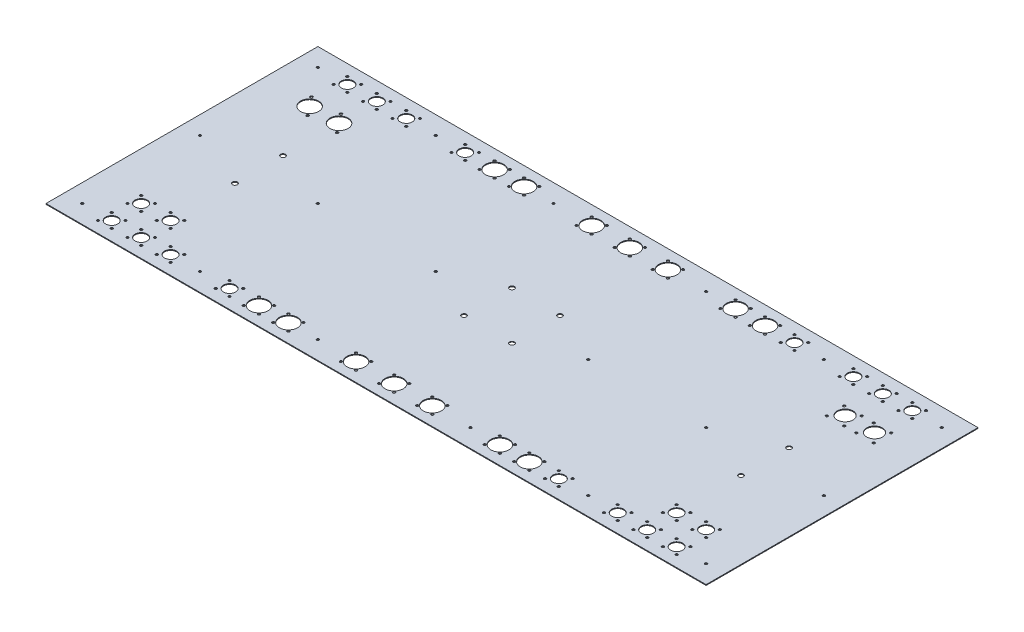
from build123d import *

# Parameters (mm, degrees)
MAIN_PLATE_W        = 874
MAIN_PLATE_H        = 360
BOSS_EXTRUDE1_DEPTH = 1.016
SKETCH2_R           = 1.6
SKETCH2_R_2         = 3.175
CUT_EXTRUDE1_DEPTH  = 473.620389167
FAN_R               = 1.6
FAN_R_2             = 12
CUT_EXTRUDE2_DEPTH  = 474.008271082
NTYPE_R             = 8
NTYPE_R_2           = 1.6
CUT_EXTRUDE3_DEPTH  = 473.620389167
ETHERNET_R          = 12
ETHERNET_R_2        = 1.755
CUT_EXTRUDE6_DEPTH  = 10
POWER_R             = 10.4521
POWER_R_2           = 1.5875
CUT_EXTRUDE7_DEPTH  = 10


with BuildPart() as part:
    # main_plate → Boss-Extrude1 (new body)
    with BuildSketch(Plane(origin=(0, 0, 0), x_dir=(1, 0, 0), z_dir=(0, 1, 0))):
        Rectangle(MAIN_PLATE_W, MAIN_PLATE_H)
    extrude(amount=BOSS_EXTRUDE1_DEPTH)

    # Sketch2 → Cut-Extrude1 (cut, through all)
    with BuildSketch(Plane(origin=(0, 1.016, 0), x_dir=(1, 0, 0), z_dir=(0, 1, 0))):
        with Locations(Location((-413, 156, 0), (0, 0, 270))):
            Circle(SKETCH2_R)
        with Locations(Location((-335, 31.805896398, 0), (0, 0, 270))):
            Circle(SKETCH2_R_2)
        with Locations(Location((-335, -31.805896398, 0), (0, 0, 90))):
            Circle(SKETCH2_R_2)
        with Locations(Location((-257, 156, 0), (0, 0, 270))):
            Circle(SKETCH2_R)
        with Locations(Location((-101, 156, 0), (0, 0, 270))):
            Circle(SKETCH2_R)
        with Locations(Location((-257, 0, 0), (0, 0, 270))):
            Circle(SKETCH2_R)
        with Locations(Location((-101, 0, 0), (0, 0, 270))):
            Circle(SKETCH2_R)
        with Locations(Location((-257, -156, 0), (0, 0, 270))):
            Circle(SKETCH2_R)
        with Locations(Location((-101, -156, 0), (0, 0, 270))):
            Circle(SKETCH2_R)
        with Locations(Location((-413, 0, 0), (0, 0, 270))):
            Circle(SKETCH2_R)
        with Locations(Location((-413, -156, 0), (0, 0, 270))):
            Circle(SKETCH2_R)
        with Locations(Location((-31.75, 31.75, 0), (0, 0, 270))):
            Circle(SKETCH2_R_2)
        with Locations(Location((-31.75, -31.75, 0), (0, 0, 90))):
            Circle(SKETCH2_R_2)
        with Locations(Location((31.75, -31.75, 0), (0, 0, 270))):
            Circle(SKETCH2_R_2)
        with Locations(Location((31.75, 31.75, 0), (0, 0, 90))):
            Circle(SKETCH2_R_2)
        with Locations(Location((413, -156, 0), (0, 0, 90))):
            Circle(SKETCH2_R)
        with Locations(Location((413, 0, 0), (0, 0, 90))):
            Circle(SKETCH2_R)
        with Locations(Location((101, -156, 0), (0, 0, 90))):
            Circle(SKETCH2_R)
        with Locations(Location((257, -156, 0), (0, 0, 90))):
            Circle(SKETCH2_R)
        with Locations(Location((101, 0, 0), (0, 0, 90))):
            Circle(SKETCH2_R)
        with Locations(Location((257, 0, 0), (0, 0, 90))):
            Circle(SKETCH2_R)
        with Locations(Location((101, 156, 0), (0, 0, 90))):
            Circle(SKETCH2_R)
        with Locations(Location((257, 156, 0), (0, 0, 90))):
            Circle(SKETCH2_R)
        with Locations(Location((335, -31.805896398, 0), (0, 0, 270))):
            Circle(SKETCH2_R_2)
        with Locations(Location((335, 31.805896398, 0), (0, 0, 90))):
            Circle(SKETCH2_R_2)
        with Locations(Location((413, 156, 0), (0, 0, 90))):
            Circle(SKETCH2_R)
    extrude(amount=-CUT_EXTRUDE1_DEPTH, mode=Mode.SUBTRACT)

    # fan → Cut-Extrude2 (cut, through all)
    with BuildSketch(Plane(origin=(0, 1.016, 1.016), x_dir=(1, 0, 0), z_dir=(0, 1, 0))):
        with Locations(Location((130, -144.984, 0), (0, 0, 270))):
            Circle(FAN_R)
        with Locations(Location((150, -144.984, 0), (0, 0, 270))):
            Circle(FAN_R)
        with Locations(Location((150, -164.984, 0), (0, 0, 270))):
            Circle(FAN_R)
        with Locations(Location((130, -164.984, 0), (0, 0, 270))):
            Circle(FAN_R)
        with Locations(Location((140, -154.984, 0), (0, 0, 270))):
            Circle(FAN_R_2)
        with Locations(Location((169, -144.984, 0), (0, 0, 270))):
            Circle(FAN_R)
        with Locations(Location((189, -144.984, 0), (0, 0, 270))):
            Circle(FAN_R)
        with Locations(Location((189, -164.984, 0), (0, 0, 270))):
            Circle(FAN_R)
        with Locations(Location((169, -164.984, 0), (0, 0, 270))):
            Circle(FAN_R)
        with Locations(Location((179, -154.984, 0), (0, 0, 270))):
            Circle(FAN_R_2)
        with Locations(Location((-10, -144.984, 0), (0, 0, 270))):
            Circle(FAN_R)
        with Locations(Location((10, -144.984, 0), (0, 0, 270))):
            Circle(FAN_R)
        with Locations(Location((10, -164.984, 0), (0, 0, 270))):
            Circle(FAN_R)
        with Locations(Location((-10, -164.984, 0), (0, 0, 270))):
            Circle(FAN_R)
        with Locations(Location((0, -154.984, 0), (0, 0, 270))):
            Circle(FAN_R_2)
        with Locations(Location((-60.5, -144.984, 0), (0, 0, 270))):
            Circle(FAN_R)
        with Locations(Location((-40.5, -144.984, 0), (0, 0, 270))):
            Circle(FAN_R)
        with Locations(Location((-40.5, -164.984, 0), (0, 0, 270))):
            Circle(FAN_R)
        with Locations(Location((-60.5, -164.984, 0), (0, 0, 270))):
            Circle(FAN_R)
        with Locations(Location((-50.5, -154.984, 0), (0, 0, 270))):
            Circle(FAN_R_2)
        with Locations(Location((40.5, -144.984, 0), (0, 0, 270))):
            Circle(FAN_R)
        with Locations(Location((60.5, -144.984, 0), (0, 0, 270))):
            Circle(FAN_R)
        with Locations(Location((60.5, -164.984, 0), (0, 0, 270))):
            Circle(FAN_R)
        with Locations(Location((40.5, -164.984, 0), (0, 0, 270))):
            Circle(FAN_R)
        with Locations(Location((50.5, -154.984, 0), (0, 0, 270))):
            Circle(FAN_R_2)
        with Locations(Location((-10, 167.016, 0), (0, 0, 270))):
            Circle(FAN_R)
        with Locations(Location((10, 167.016, 0), (0, 0, 270))):
            Circle(FAN_R)
        with Locations(Location((10, 147.016, 0), (0, 0, 270))):
            Circle(FAN_R)
        with Locations(Location((-10, 147.016, 0), (0, 0, 270))):
            Circle(FAN_R)
        with Locations(Location((0, 157.016, 0), (0, 0, 270))):
            Circle(FAN_R_2)
        with Locations(Location((-60.5, 167.016, 0), (0, 0, 270))):
            Circle(FAN_R)
        with Locations(Location((-40.5, 167.016, 0), (0, 0, 270))):
            Circle(FAN_R)
        with Locations(Location((-40.5, 147.016, 0), (0, 0, 270))):
            Circle(FAN_R)
        with Locations(Location((-60.5, 147.016, 0), (0, 0, 270))):
            Circle(FAN_R)
        with Locations(Location((-50.5, 157.016, 0), (0, 0, 270))):
            Circle(FAN_R_2)
        with Locations(Location((40.5, 167.016, 0), (0, 0, 270))):
            Circle(FAN_R)
        with Locations(Location((60.5, 167.016, 0), (0, 0, 270))):
            Circle(FAN_R)
        with Locations(Location((60.5, 147.016, 0), (0, 0, 270))):
            Circle(FAN_R)
        with Locations(Location((40.5, 147.016, 0), (0, 0, 270))):
            Circle(FAN_R)
        with Locations(Location((50.5, 157.016, 0), (0, 0, 270))):
            Circle(FAN_R_2)
        with Locations(Location((-189, -144.984, 0), (0, 0, 270))):
            Circle(FAN_R)
        with Locations(Location((-169, -144.984, 0), (0, 0, 270))):
            Circle(FAN_R)
        with Locations(Location((-169, -164.984, 0), (0, 0, 270))):
            Circle(FAN_R)
        with Locations(Location((-189, -164.984, 0), (0, 0, 270))):
            Circle(FAN_R)
        with Locations(Location((-179, -154.984, 0), (0, 0, 270))):
            Circle(FAN_R_2)
        with Locations(Location((-150, -144.984, 0), (0, 0, 270))):
            Circle(FAN_R)
        with Locations(Location((-130, -144.984, 0), (0, 0, 270))):
            Circle(FAN_R)
        with Locations(Location((-130, -164.984, 0), (0, 0, 270))):
            Circle(FAN_R)
        with Locations(Location((-150, -164.984, 0), (0, 0, 270))):
            Circle(FAN_R)
        with Locations(Location((-140, -154.984, 0), (0, 0, 270))):
            Circle(FAN_R_2)
        with Locations(Location((-189, 167.016, 0), (0, 0, 270))):
            Circle(FAN_R)
        with Locations(Location((-169, 167.016, 0), (0, 0, 270))):
            Circle(FAN_R)
        with Locations(Location((-169, 147.016, 0), (0, 0, 270))):
            Circle(FAN_R)
        with Locations(Location((-189, 147.016, 0), (0, 0, 270))):
            Circle(FAN_R)
        with Locations(Location((-179, 157.016, 0), (0, 0, 270))):
            Circle(FAN_R_2)
        with Locations(Location((-150, 167.016, 0), (0, 0, 270))):
            Circle(FAN_R)
        with Locations(Location((-130, 167.016, 0), (0, 0, 270))):
            Circle(FAN_R)
        with Locations(Location((-130, 147.016, 0), (0, 0, 270))):
            Circle(FAN_R)
        with Locations(Location((-150, 147.016, 0), (0, 0, 270))):
            Circle(FAN_R)
        with Locations(Location((-140, 157.016, 0), (0, 0, 270))):
            Circle(FAN_R_2)
        with Locations(Location((130, 167.016, 0), (0, 0, 270))):
            Circle(FAN_R)
        with Locations(Location((150, 167.016, 0), (0, 0, 270))):
            Circle(FAN_R)
        with Locations(Location((150, 147.016, 0), (0, 0, 270))):
            Circle(FAN_R)
        with Locations(Location((130, 147.016, 0), (0, 0, 270))):
            Circle(FAN_R)
        with Locations(Location((140, 157.016, 0), (0, 0, 270))):
            Circle(FAN_R_2)
        with Locations(Location((169, 167.016, 0), (0, 0, 270))):
            Circle(FAN_R)
        with Locations(Location((189, 167.016, 0), (0, 0, 270))):
            Circle(FAN_R)
        with Locations(Location((189, 147.016, 0), (0, 0, 270))):
            Circle(FAN_R)
        with Locations(Location((169, 147.016, 0), (0, 0, 270))):
            Circle(FAN_R)
        with Locations(Location((179, 157.016, 0), (0, 0, 270))):
            Circle(FAN_R_2)
    extrude(amount=-CUT_EXTRUDE2_DEPTH, mode=Mode.SUBTRACT)

    # ntype → Cut-Extrude3 (cut, through all)
    with BuildSketch(Plane(origin=(0, 1.016, 0), x_dir=(1, 0, 0), z_dir=(0, 1, 0))):
        with Locations(Location((-218, 156, 0), (0, 0, 270))):
            Circle(NTYPE_R)
        with Locations(Location((-227.1, 165.1, 0), (0, 0, 270))):
            Circle(NTYPE_R_2)
        with Locations(Location((-208.9, 165.1, 0), (0, 0, 270))):
            Circle(NTYPE_R_2)
        with Locations(Location((-208.9, 146.9, 0), (0, 0, 270))):
            Circle(NTYPE_R_2)
        with Locations(Location((-227.1, 146.9, 0), (0, 0, 270))):
            Circle(NTYPE_R_2)
        with Locations(Location((218, 156, 0), (0, 0, 270))):
            Circle(NTYPE_R)
        with Locations(Location((208.9, 165.1, 0), (0, 0, 270))):
            Circle(NTYPE_R_2)
        with Locations(Location((227.1, 165.1, 0), (0, 0, 270))):
            Circle(NTYPE_R_2)
        with Locations(Location((227.1, 146.9, 0), (0, 0, 270))):
            Circle(NTYPE_R_2)
        with Locations(Location((208.9, 146.9, 0), (0, 0, 270))):
            Circle(NTYPE_R_2)
        with Locations(Location((-218, -156, 0), (0, 0, 270))):
            Circle(NTYPE_R)
        with Locations(Location((-227.1, -146.9, 0), (0, 0, 270))):
            Circle(NTYPE_R_2)
        with Locations(Location((-208.9, -146.9, 0), (0, 0, 270))):
            Circle(NTYPE_R_2)
        with Locations(Location((-208.9, -165.1, 0), (0, 0, 270))):
            Circle(NTYPE_R_2)
        with Locations(Location((-227.1, -165.1, 0), (0, 0, 270))):
            Circle(NTYPE_R_2)
        with Locations(Location((218, -156, 0), (0, 0, 270))):
            Circle(NTYPE_R)
        with Locations(Location((208.9, -146.9, 0), (0, 0, 270))):
            Circle(NTYPE_R_2)
        with Locations(Location((227.1, -146.9, 0), (0, 0, 270))):
            Circle(NTYPE_R_2)
        with Locations(Location((227.1, -165.1, 0), (0, 0, 270))):
            Circle(NTYPE_R_2)
        with Locations(Location((208.9, -165.1, 0), (0, 0, 270))):
            Circle(NTYPE_R_2)
        with Locations(Location((-374, 156, 0), (0, 0, 270))):
            Circle(NTYPE_R)
        with Locations(Location((-383.1, 165.1, 0), (0, 0, 270))):
            Circle(NTYPE_R_2)
        with Locations(Location((-364.9, 165.1, 0), (0, 0, 270))):
            Circle(NTYPE_R_2)
        with Locations(Location((-364.9, 146.9, 0), (0, 0, 270))):
            Circle(NTYPE_R_2)
        with Locations(Location((-383.1, 146.9, 0), (0, 0, 270))):
            Circle(NTYPE_R_2)
        with Locations(Location((-296, 156, 0), (0, 0, 270))):
            Circle(NTYPE_R)
        with Locations(Location((-305.1, 165.1, 0), (0, 0, 270))):
            Circle(NTYPE_R_2)
        with Locations(Location((-286.9, 165.1, 0), (0, 0, 270))):
            Circle(NTYPE_R_2)
        with Locations(Location((-286.9, 146.9, 0), (0, 0, 270))):
            Circle(NTYPE_R_2)
        with Locations(Location((-305.1, 146.9, 0), (0, 0, 270))):
            Circle(NTYPE_R_2)
        with Locations(Location((-335, 156, 0), (0, 0, 270))):
            Circle(NTYPE_R)
        with Locations(Location((-344.1, 165.1, 0), (0, 0, 270))):
            Circle(NTYPE_R_2)
        with Locations(Location((-325.9, 165.1, 0), (0, 0, 270))):
            Circle(NTYPE_R_2)
        with Locations(Location((-325.9, 146.9, 0), (0, 0, 270))):
            Circle(NTYPE_R_2)
        with Locations(Location((-344.1, 146.9, 0), (0, 0, 270))):
            Circle(NTYPE_R_2)
        with Locations(Location((296, -156, 0), (0, 0, 270))):
            Circle(NTYPE_R)
        with Locations(Location((286.9, -146.9, 0), (0, 0, 270))):
            Circle(NTYPE_R_2)
        with Locations(Location((305.1, -146.9, 0), (0, 0, 270))):
            Circle(NTYPE_R_2)
        with Locations(Location((305.1, -165.1, 0), (0, 0, 270))):
            Circle(NTYPE_R_2)
        with Locations(Location((286.9, -165.1, 0), (0, 0, 270))):
            Circle(NTYPE_R_2)
        with Locations(Location((374, -156, 0), (0, 0, 270))):
            Circle(NTYPE_R)
        with Locations(Location((364.9, -146.9, 0), (0, 0, 270))):
            Circle(NTYPE_R_2)
        with Locations(Location((383.1, -146.9, 0), (0, 0, 270))):
            Circle(NTYPE_R_2)
        with Locations(Location((383.1, -165.1, 0), (0, 0, 270))):
            Circle(NTYPE_R_2)
        with Locations(Location((364.9, -165.1, 0), (0, 0, 270))):
            Circle(NTYPE_R_2)
        with Locations(Location((335, -156, 0), (0, 0, 270))):
            Circle(NTYPE_R)
        with Locations(Location((325.9, -146.9, 0), (0, 0, 270))):
            Circle(NTYPE_R_2)
        with Locations(Location((344.1, -146.9, 0), (0, 0, 270))):
            Circle(NTYPE_R_2)
        with Locations(Location((344.1, -165.1, 0), (0, 0, 270))):
            Circle(NTYPE_R_2)
        with Locations(Location((325.9, -165.1, 0), (0, 0, 270))):
            Circle(NTYPE_R_2)
        with Locations(Location((296, 156, 0), (0, 0, 270))):
            Circle(NTYPE_R)
        with Locations(Location((286.9, 165.1, 0), (0, 0, 270))):
            Circle(NTYPE_R_2)
        with Locations(Location((305.1, 165.1, 0), (0, 0, 270))):
            Circle(NTYPE_R_2)
        with Locations(Location((305.1, 146.9, 0), (0, 0, 270))):
            Circle(NTYPE_R_2)
        with Locations(Location((286.9, 146.9, 0), (0, 0, 270))):
            Circle(NTYPE_R_2)
        with Locations(Location((374, 156, 0), (0, 0, 270))):
            Circle(NTYPE_R)
        with Locations(Location((364.9, 165.1, 0), (0, 0, 270))):
            Circle(NTYPE_R_2)
        with Locations(Location((383.1, 165.1, 0), (0, 0, 270))):
            Circle(NTYPE_R_2)
        with Locations(Location((383.1, 146.9, 0), (0, 0, 270))):
            Circle(NTYPE_R_2)
        with Locations(Location((364.9, 146.9, 0), (0, 0, 270))):
            Circle(NTYPE_R_2)
        with Locations(Location((335, 156, 0), (0, 0, 270))):
            Circle(NTYPE_R)
        with Locations(Location((325.9, 165.1, 0), (0, 0, 270))):
            Circle(NTYPE_R_2)
        with Locations(Location((344.1, 165.1, 0), (0, 0, 270))):
            Circle(NTYPE_R_2)
        with Locations(Location((344.1, 146.9, 0), (0, 0, 270))):
            Circle(NTYPE_R_2)
        with Locations(Location((325.9, 146.9, 0), (0, 0, 270))):
            Circle(NTYPE_R_2)
        with Locations(Location((-374, -156, 0), (0, 0, 270))):
            Circle(NTYPE_R)
        with Locations(Location((-383.1, -146.9, 0), (0, 0, 270))):
            Circle(NTYPE_R_2)
        with Locations(Location((-364.9, -146.9, 0), (0, 0, 270))):
            Circle(NTYPE_R_2)
        with Locations(Location((-364.9, -165.1, 0), (0, 0, 270))):
            Circle(NTYPE_R_2)
        with Locations(Location((-383.1, -165.1, 0), (0, 0, 270))):
            Circle(NTYPE_R_2)
        with Locations(Location((-296, -156, 0), (0, 0, 270))):
            Circle(NTYPE_R)
        with Locations(Location((-305.1, -146.9, 0), (0, 0, 270))):
            Circle(NTYPE_R_2)
        with Locations(Location((-286.9, -146.9, 0), (0, 0, 270))):
            Circle(NTYPE_R_2)
        with Locations(Location((-286.9, -165.1, 0), (0, 0, 270))):
            Circle(NTYPE_R_2)
        with Locations(Location((-305.1, -165.1, 0), (0, 0, 270))):
            Circle(NTYPE_R_2)
        with Locations(Location((-335, -156, 0), (0, 0, 270))):
            Circle(NTYPE_R)
        with Locations(Location((-344.1, -146.9, 0), (0, 0, 270))):
            Circle(NTYPE_R_2)
        with Locations(Location((-325.9, -146.9, 0), (0, 0, 270))):
            Circle(NTYPE_R_2)
        with Locations(Location((-325.9, -165.1, 0), (0, 0, 270))):
            Circle(NTYPE_R_2)
        with Locations(Location((-344.1, -165.1, 0), (0, 0, 270))):
            Circle(NTYPE_R_2)
        with Locations(Location((-335, -117, 0), (0, 0, 270))):
            Circle(NTYPE_R)
        with Locations(Location((-344.1, -107.9, 0), (0, 0, 270))):
            Circle(NTYPE_R_2)
        with Locations(Location((-325.9, -107.9, 0), (0, 0, 270))):
            Circle(NTYPE_R_2)
        with Locations(Location((-325.9, -126.1, 0), (0, 0, 270))):
            Circle(NTYPE_R_2)
        with Locations(Location((-344.1, -126.1, 0), (0, 0, 270))):
            Circle(NTYPE_R_2)
        with Locations(Location((-374, -117, 0), (0, 0, 270))):
            Circle(NTYPE_R)
        with Locations(Location((-383.1, -107.9, 0), (0, 0, 270))):
            Circle(NTYPE_R_2)
        with Locations(Location((-364.9, -107.9, 0), (0, 0, 270))):
            Circle(NTYPE_R_2)
        with Locations(Location((-364.9, -126.1, 0), (0, 0, 270))):
            Circle(NTYPE_R_2)
        with Locations(Location((-383.1, -126.1, 0), (0, 0, 270))):
            Circle(NTYPE_R_2)
        with Locations(Location((374, -117, 0), (0, 0, 270))):
            Circle(NTYPE_R)
        with Locations(Location((364.9, -107.9, 0), (0, 0, 270))):
            Circle(NTYPE_R_2)
        with Locations(Location((383.1, -107.9, 0), (0, 0, 270))):
            Circle(NTYPE_R_2)
        with Locations(Location((383.1, -126.1, 0), (0, 0, 270))):
            Circle(NTYPE_R_2)
        with Locations(Location((364.9, -126.1, 0), (0, 0, 270))):
            Circle(NTYPE_R_2)
        with Locations(Location((335, -117, 0), (0, 0, 270))):
            Circle(NTYPE_R)
        with Locations(Location((325.9, -107.9, 0), (0, 0, 270))):
            Circle(NTYPE_R_2)
        with Locations(Location((344.1, -107.9, 0), (0, 0, 270))):
            Circle(NTYPE_R_2)
        with Locations(Location((344.1, -126.1, 0), (0, 0, 270))):
            Circle(NTYPE_R_2)
        with Locations(Location((325.9, -126.1, 0), (0, 0, 270))):
            Circle(NTYPE_R_2)
    extrude(amount=-CUT_EXTRUDE3_DEPTH, mode=Mode.SUBTRACT)

    # ethernet → Cut-Extrude6 (cut)
    with BuildSketch(Plane(origin=(0, 1.016, 0), x_dir=(1, 0, 0), z_dir=(0, 1, 0))):
        with Locations(Location((-374, 106, 0), (0, 0, 270))):
            Circle(ETHERNET_R)
        with Locations(Location((-383.5, 118, 0), (0, 0, 270))):
            Circle(ETHERNET_R_2)
        with Locations(Location((-364.5, 94, 0), (0, 0, 270))):
            Circle(ETHERNET_R_2)
        with Locations(Location((-335, 106, 0), (0, 0, 270))):
            Circle(ETHERNET_R)
        with Locations(Location((-344.5, 118, 0), (0, 0, 270))):
            Circle(ETHERNET_R_2)
        with Locations(Location((-325.5, 94, 0), (0, 0, 270))):
            Circle(ETHERNET_R_2)
    extrude(amount=-CUT_EXTRUDE6_DEPTH, mode=Mode.SUBTRACT)

    # power → Cut-Extrude7 (cut)
    with BuildSketch(Plane(origin=(0, 1.016, 0), x_dir=(1, 0, 0), z_dir=(0, 1, 0))):
        with Locations(Location((374, 106, 0), (0, 0, 270))):
            Circle(POWER_R)
        with Locations(Location((362.4938, 116.4521, 0), (0, 0, 270))):
            Circle(POWER_R_2)
        with Locations(Location((385.5062, 116.4521, 0), (0, 0, 270))):
            Circle(POWER_R_2)
        with Locations(Location((385.5062, 93.4397, 0), (0, 0, 270))):
            Circle(POWER_R_2)
        with Locations(Location((362.4938, 93.4397, 0), (0, 0, 270))):
            Circle(POWER_R_2)
        with Locations(Location((335, 106, 0), (0, 0, 270))):
            Circle(POWER_R)
        with Locations(Location((323.4938, 116.4521, 0), (0, 0, 270))):
            Circle(POWER_R_2)
        with Locations(Location((346.5062, 116.4521, 0), (0, 0, 270))):
            Circle(POWER_R_2)
        with Locations(Location((346.5062, 93.4397, 0), (0, 0, 270))):
            Circle(POWER_R_2)
        with Locations(Location((323.4938, 93.4397, 0), (0, 0, 270))):
            Circle(POWER_R_2)
    extrude(amount=-CUT_EXTRUDE7_DEPTH, mode=Mode.SUBTRACT)


solid = part.part
